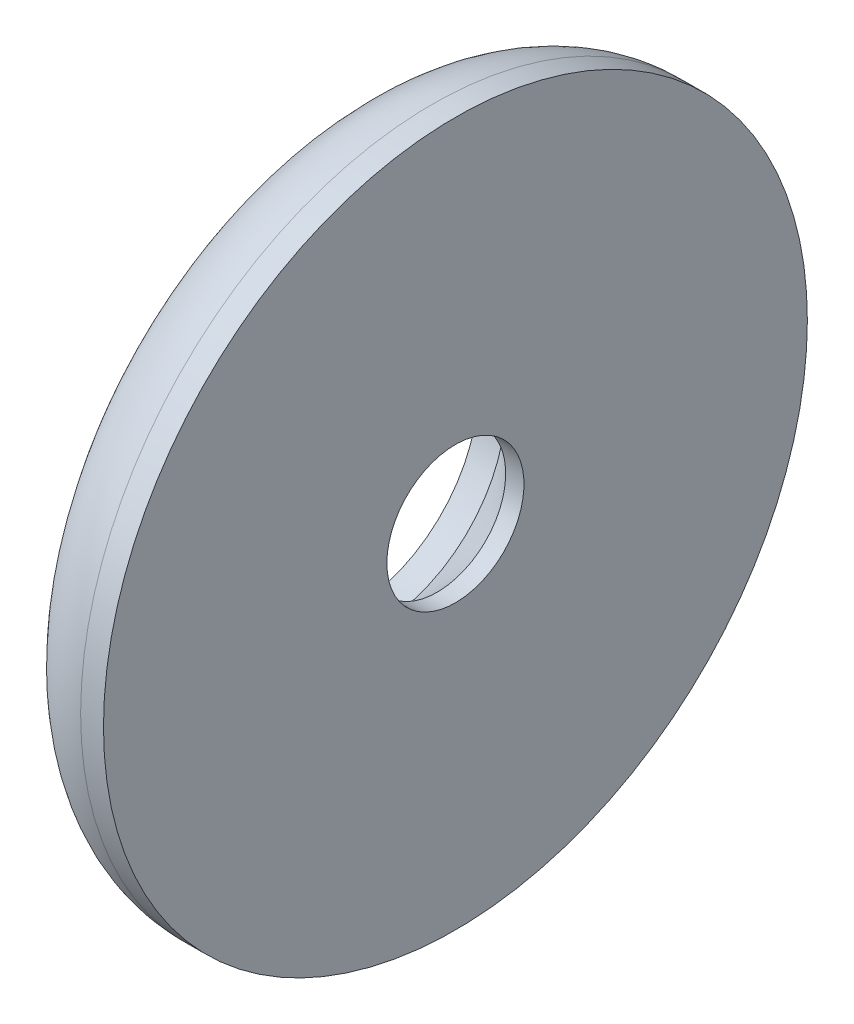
ISO-10303-21;
HEADER;
FILE_DESCRIPTION(('STEP AP214'),'2;1');
FILE_NAME('part.step','',(''),(''),'','','');
FILE_SCHEMA(('AUTOMOTIVE_DESIGN { 1 0 10303 214 1 1 1 1 }'));
ENDSEC;
DATA;
#1=APPLICATION_CONTEXT('core data for automotive mechanical design processes');
#2=APPLICATION_PROTOCOL_DEFINITION('international standard','automotive_design',2000,#1);
#3=PRODUCT_CONTEXT('',#1,'mechanical');
#4=PRODUCT('Part','Part','',(#3));
#5=PRODUCT_RELATED_PRODUCT_CATEGORY('part','',(#4));
#6=PRODUCT_DEFINITION_FORMATION('','',#4);
#7=PRODUCT_DEFINITION_CONTEXT('part definition',#1,'design');
#8=PRODUCT_DEFINITION('design','',#6,#7);
#9=PRODUCT_DEFINITION_SHAPE('','',#8);
#10=(LENGTH_UNIT() NAMED_UNIT(*) SI_UNIT(.MILLI.,.METRE.));
#11=(NAMED_UNIT(*) PLANE_ANGLE_UNIT() SI_UNIT($,.RADIAN.));
#12=(NAMED_UNIT(*) SI_UNIT($,.STERADIAN.) SOLID_ANGLE_UNIT());
#13=UNCERTAINTY_MEASURE_WITH_UNIT(LENGTH_MEASURE(1.E-05),#10,'distance_accuracy_value','');
#14=(GEOMETRIC_REPRESENTATION_CONTEXT(3) GLOBAL_UNCERTAINTY_ASSIGNED_CONTEXT((#13)) GLOBAL_UNIT_ASSIGNED_CONTEXT((#10,
#11,#12)) REPRESENTATION_CONTEXT('',''));
#15=CARTESIAN_POINT('',(0.,0.,0.));
#16=DIRECTION('',(0.,0.,1.));
#17=DIRECTION('',(1.,0.,0.));
#18=AXIS2_PLACEMENT_3D('',#15,#16,#17);
#19=CARTESIAN_POINT('',(-1.15,0.,0.));
#20=DIRECTION('',(-1.,0.,0.));
#21=DIRECTION('',(0.,0.,1.));
#22=AXIS2_PLACEMENT_3D('',#19,#20,#21);
#23=CYLINDRICAL_SURFACE('',#22,7.7);
#24=CARTESIAN_POINT('',(0.65,0.,0.));
#25=DIRECTION('',(1.,0.,0.));
#26=DIRECTION('',(0.,0.,-1.));
#27=AXIS2_PLACEMENT_3D('',#24,#25,#26);
#28=CIRCLE('',#27,7.7);
#29=CARTESIAN_POINT('',(0.65,0.,-7.7));
#30=VERTEX_POINT('',#29);
#31=EDGE_CURVE('E10',#30,#30,#28,.T.);
#32=ORIENTED_EDGE('',*,*,#31,.T.);
#33=EDGE_LOOP('',(#32));
#34=FACE_BOUND('',#33,.T.);
#35=CARTESIAN_POINT('',(1.15,0.,0.));
#36=DIRECTION('',(-1.,0.,0.));
#37=DIRECTION('',(0.,0.,1.));
#38=AXIS2_PLACEMENT_3D('',#35,#36,#37);
#39=CIRCLE('',#38,7.7);
#40=CARTESIAN_POINT('',(1.15,0.,7.7));
#41=VERTEX_POINT('',#40);
#42=EDGE_CURVE('E61',#41,#41,#39,.T.);
#43=ORIENTED_EDGE('',*,*,#42,.T.);
#44=EDGE_LOOP('',(#43));
#45=FACE_BOUND('',#44,.T.);
#46=ADVANCED_FACE('F35',(#34,#45),#23,.T.);
#47=CARTESIAN_POINT('',(-1.15,7.7,0.));
#48=DIRECTION('',(1.,0.,0.));
#49=DIRECTION('',(0.,0.,-1.));
#50=AXIS2_PLACEMENT_3D('',#47,#48,#49);
#51=PLANE('',#50);
#52=CARTESIAN_POINT('',(-1.15,0.,0.));
#53=DIRECTION('',(1.,0.,0.));
#54=DIRECTION('',(0.,0.,-1.));
#55=AXIS2_PLACEMENT_3D('',#52,#53,#54);
#56=CIRCLE('',#55,5.9);
#57=CARTESIAN_POINT('',(-1.15,0.,-5.9));
#58=VERTEX_POINT('',#57);
#59=EDGE_CURVE('E42',#58,#58,#56,.F.);
#60=ORIENTED_EDGE('',*,*,#59,.T.);
#61=EDGE_LOOP('',(#60));
#62=FACE_BOUND('',#61,.T.);
#63=CARTESIAN_POINT('',(-1.15,0.,0.));
#64=DIRECTION('',(-1.,0.,0.));
#65=DIRECTION('',(0.,0.,1.));
#66=AXIS2_PLACEMENT_3D('',#63,#64,#65);
#67=CIRCLE('',#66,2.8);
#68=CARTESIAN_POINT('',(-1.15,0.,2.8));
#69=VERTEX_POINT('',#68);
#70=EDGE_CURVE('E46',#69,#69,#67,.T.);
#71=ORIENTED_EDGE('',*,*,#70,.F.);
#72=EDGE_LOOP('',(#71));
#73=FACE_BOUND('',#72,.T.);
#74=ADVANCED_FACE('F87',(#62,#73),#51,.F.);
#75=CARTESIAN_POINT('',(-1.15,0.,0.));
#76=DIRECTION('',(-1.,0.,0.));
#77=DIRECTION('',(0.,0.,1.));
#78=AXIS2_PLACEMENT_3D('',#75,#76,#77);
#79=CYLINDRICAL_SURFACE('',#78,2.8);
#80=CARTESIAN_POINT('',(-0.549999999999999,0.,0.));
#81=DIRECTION('',(-1.,0.,0.));
#82=DIRECTION('',(0.,0.,1.));
#83=AXIS2_PLACEMENT_3D('',#80,#81,#82);
#84=CIRCLE('',#83,2.8);
#85=CARTESIAN_POINT('',(-0.549999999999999,0.,2.8));
#86=VERTEX_POINT('',#85);
#87=EDGE_CURVE('E50',#86,#86,#84,.T.);
#88=ORIENTED_EDGE('',*,*,#87,.F.);
#89=EDGE_LOOP('',(#88));
#90=FACE_BOUND('',#89,.T.);
#91=ORIENTED_EDGE('',*,*,#70,.T.);
#92=EDGE_LOOP('',(#91));
#93=FACE_BOUND('',#92,.T.);
#94=ADVANCED_FACE('F81',(#90,#93),#79,.F.);
#95=CARTESIAN_POINT('',(-0.549999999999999,0.,0.));
#96=DIRECTION('',(-1.,0.,0.));
#97=DIRECTION('',(0.,0.,1.));
#98=AXIS2_PLACEMENT_3D('',#95,#96,#97);
#99=CONICAL_SURFACE('',#98,2.8,0.78539816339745);
#100=CARTESIAN_POINT('',(0.749999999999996,0.,0.));
#101=DIRECTION('',(-1.,0.,0.));
#102=DIRECTION('',(0.,0.,1.));
#103=AXIS2_PLACEMENT_3D('',#100,#101,#102);
#104=CIRCLE('',#103,1.5);
#105=CARTESIAN_POINT('',(0.749999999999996,0.,1.5));
#106=VERTEX_POINT('',#105);
#107=EDGE_CURVE('E55',#106,#106,#104,.T.);
#108=ORIENTED_EDGE('',*,*,#107,.F.);
#109=EDGE_LOOP('',(#108));
#110=FACE_BOUND('',#109,.T.);
#111=ORIENTED_EDGE('',*,*,#87,.T.);
#112=EDGE_LOOP('',(#111));
#113=FACE_BOUND('',#112,.T.);
#114=ADVANCED_FACE('F75',(#110,#113),#99,.F.);
#115=CARTESIAN_POINT('',(-1.15,0.,0.));
#116=DIRECTION('',(-1.,0.,0.));
#117=DIRECTION('',(0.,0.,1.));
#118=AXIS2_PLACEMENT_3D('',#115,#116,#117);
#119=CYLINDRICAL_SURFACE('',#118,1.5);
#120=CARTESIAN_POINT('',(1.15,0.,0.));
#121=DIRECTION('',(-1.,0.,0.));
#122=DIRECTION('',(0.,0.,1.));
#123=AXIS2_PLACEMENT_3D('',#120,#121,#122);
#124=CIRCLE('',#123,1.5);
#125=CARTESIAN_POINT('',(1.15,0.,1.5));
#126=VERTEX_POINT('',#125);
#127=EDGE_CURVE('E58',#126,#126,#124,.T.);
#128=ORIENTED_EDGE('',*,*,#127,.F.);
#129=EDGE_LOOP('',(#128));
#130=FACE_BOUND('',#129,.T.);
#131=ORIENTED_EDGE('',*,*,#107,.T.);
#132=EDGE_LOOP('',(#131));
#133=FACE_BOUND('',#132,.T.);
#134=ADVANCED_FACE('F69',(#130,#133),#119,.F.);
#135=CARTESIAN_POINT('',(1.15,1.5,0.));
#136=DIRECTION('',(-1.,0.,0.));
#137=DIRECTION('',(0.,0.,1.));
#138=AXIS2_PLACEMENT_3D('',#135,#136,#137);
#139=PLANE('',#138);
#140=ORIENTED_EDGE('',*,*,#42,.F.);
#141=EDGE_LOOP('',(#140));
#142=FACE_BOUND('',#141,.T.);
#143=ORIENTED_EDGE('',*,*,#127,.T.);
#144=EDGE_LOOP('',(#143));
#145=FACE_BOUND('',#144,.T.);
#146=ADVANCED_FACE('F66',(#142,#145),#139,.F.);
#147=CARTESIAN_POINT('',(0.65,0.,0.));
#148=DIRECTION('',(1.,0.,0.));
#149=DIRECTION('',(0.,0.,-1.));
#150=AXIS2_PLACEMENT_3D('',#147,#148,#149);
#151=TOROIDAL_SURFACE('',#150,5.9,1.8);
#152=ORIENTED_EDGE('',*,*,#31,.F.);
#153=EDGE_LOOP('',(#152));
#154=FACE_BOUND('',#153,.T.);
#155=ORIENTED_EDGE('',*,*,#59,.F.);
#156=EDGE_LOOP('',(#155));
#157=FACE_BOUND('',#156,.T.);
#158=ADVANCED_FACE('F37',(#154,#157),#151,.T.);
#159=CLOSED_SHELL('',(#46,#74,#94,#114,#134,#146,#158));
#160=MANIFOLD_SOLID_BREP('B2',#159);
#161=ADVANCED_BREP_SHAPE_REPRESENTATION('',(#18,#160),#14);
#162=SHAPE_DEFINITION_REPRESENTATION(#9,#161);
ENDSEC;
END-ISO-10303-21;
